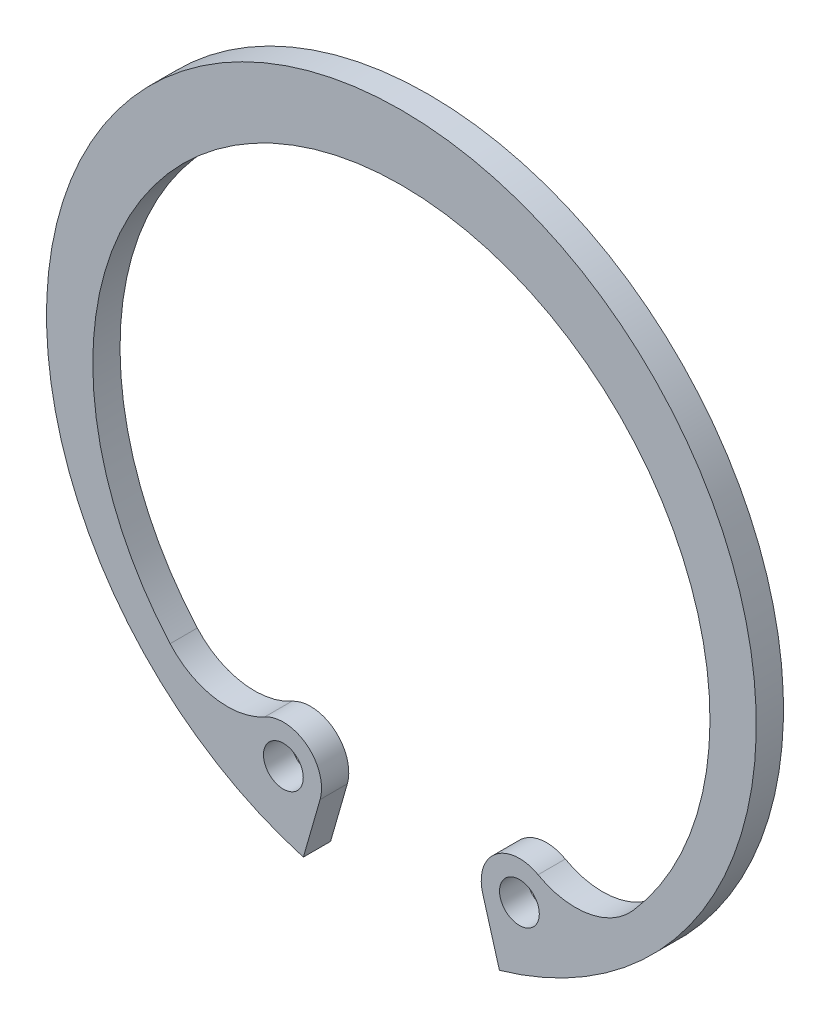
from build123d import *

# Parameters (mm, degrees)
BODYSKE_R  = 0.95
BODY_DEPTH = 1.3


with BuildPart() as part:
    # BodySke → Body (new body)
    with BuildSketch(Plane.XY):
        with BuildLine():
            Line((4.682118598, -16.290496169), (3.882989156, -13.510084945))
            ThreePointArc((3.882989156, -13.510084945), (4.503429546, -11.575687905), (6.528405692, -11.413484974))
            ThreePointArc((6.528405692, -11.413484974), (8.923472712, -11.826818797), (11.047083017, -10.64467238))
            ThreePointArc((11.047083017, -10.64467238), (0, 13.85), (-11.047083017, -10.64467238))
            ThreePointArc((-11.047083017, -10.64467238), (-8.923472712, -11.826818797), (-6.528405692, -11.413484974))
            ThreePointArc((-6.528405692, -11.413484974), (-4.503429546, -11.575687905), (-3.882989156, -13.510084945))
            Line((-3.882989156, -13.510084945), (-4.682118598, -16.290496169))
            ThreePointArc((-4.682118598, -16.290496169), (0, 16.95), (4.682118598, -16.290496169))
        make_face()
        with Locations((5.636980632, -13.005963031)):
            Circle(BODYSKE_R, mode=Mode.SUBTRACT)
        with Locations((-5.636980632, -13.005963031)):
            Circle(BODYSKE_R, mode=Mode.SUBTRACT)
    extrude(amount=-BODY_DEPTH)


solid = part.part
